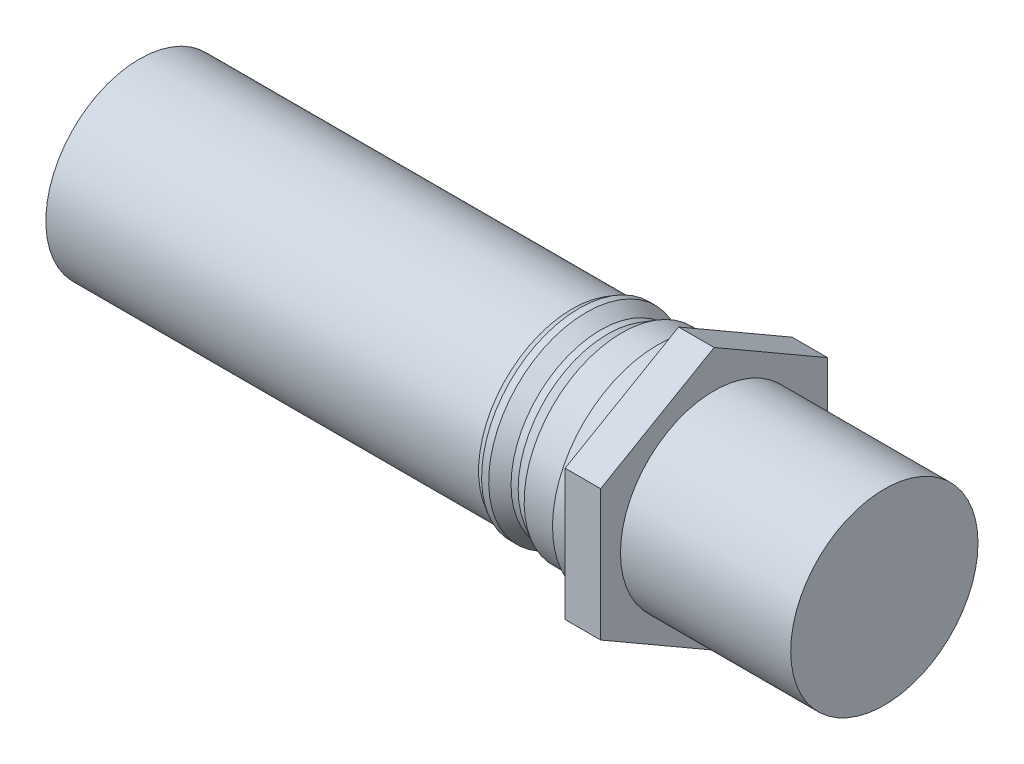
ISO-10303-21;
HEADER;
FILE_DESCRIPTION(('STEP AP214'),'2;1');
FILE_NAME('part.step','',(''),(''),'','','');
FILE_SCHEMA(('AUTOMOTIVE_DESIGN { 1 0 10303 214 1 1 1 1 }'));
ENDSEC;
DATA;
#1=APPLICATION_CONTEXT('core data for automotive mechanical design processes');
#2=APPLICATION_PROTOCOL_DEFINITION('international standard','automotive_design',2000,#1);
#3=PRODUCT_CONTEXT('',#1,'mechanical');
#4=PRODUCT('Part','Part','',(#3));
#5=PRODUCT_RELATED_PRODUCT_CATEGORY('part','',(#4));
#6=PRODUCT_DEFINITION_FORMATION('','',#4);
#7=PRODUCT_DEFINITION_CONTEXT('part definition',#1,'design');
#8=PRODUCT_DEFINITION('design','',#6,#7);
#9=PRODUCT_DEFINITION_SHAPE('','',#8);
#10=(LENGTH_UNIT() NAMED_UNIT(*) SI_UNIT(.MILLI.,.METRE.));
#11=(NAMED_UNIT(*) PLANE_ANGLE_UNIT() SI_UNIT($,.RADIAN.));
#12=(NAMED_UNIT(*) SI_UNIT($,.STERADIAN.) SOLID_ANGLE_UNIT());
#13=UNCERTAINTY_MEASURE_WITH_UNIT(LENGTH_MEASURE(1.E-05),#10,'distance_accuracy_value','');
#14=(GEOMETRIC_REPRESENTATION_CONTEXT(3) GLOBAL_UNCERTAINTY_ASSIGNED_CONTEXT((#13)) GLOBAL_UNIT_ASSIGNED_CONTEXT((#10,
#11,#12)) REPRESENTATION_CONTEXT('',''));
#15=CARTESIAN_POINT('',(0.,0.,0.));
#16=DIRECTION('',(0.,0.,1.));
#17=DIRECTION('',(1.,0.,0.));
#18=AXIS2_PLACEMENT_3D('',#15,#16,#17);
#19=CARTESIAN_POINT('',(0.,0.,0.));
#20=DIRECTION('',(-1.,0.,0.));
#21=DIRECTION('',(0.,-1.,0.));
#22=AXIS2_PLACEMENT_3D('',#19,#20,#21);
#23=PLANE('',#22);
#24=CARTESIAN_POINT('',(0.,0.,0.));
#25=DIRECTION('',(1.,0.,0.));
#26=DIRECTION('',(0.,1.,0.));
#27=AXIS2_PLACEMENT_3D('',#24,#25,#26);
#28=CIRCLE('',#27,13.2);
#29=CARTESIAN_POINT('',(0.,13.2,0.));
#30=VERTEX_POINT('',#29);
#31=EDGE_CURVE('E36',#30,#30,#28,.T.);
#32=ORIENTED_EDGE('',*,*,#31,.F.);
#33=EDGE_LOOP('',(#32));
#34=FACE_BOUND('',#33,.T.);
#35=ADVANCED_FACE('F33',(#34),#23,.T.);
#36=CARTESIAN_POINT('',(76.,0.,0.));
#37=DIRECTION('',(1.,0.,0.));
#38=DIRECTION('',(0.,1.,0.));
#39=AXIS2_PLACEMENT_3D('',#36,#37,#38);
#40=CYLINDRICAL_SURFACE('',#39,13.2);
#41=ORIENTED_EDGE('',*,*,#31,.T.);
#42=EDGE_LOOP('',(#41));
#43=FACE_BOUND('',#42,.T.);
#44=CARTESIAN_POINT('',(61.,0.,0.));
#45=DIRECTION('',(1.,0.,0.));
#46=DIRECTION('',(0.,1.,0.));
#47=AXIS2_PLACEMENT_3D('',#44,#45,#46);
#48=CIRCLE('',#47,13.2);
#49=CARTESIAN_POINT('',(61.,13.2,0.));
#50=VERTEX_POINT('',#49);
#51=EDGE_CURVE('E162',#50,#50,#48,.T.);
#52=ORIENTED_EDGE('',*,*,#51,.F.);
#53=EDGE_LOOP('',(#52));
#54=FACE_BOUND('',#53,.T.);
#55=ADVANCED_FACE('F169',(#43,#54),#40,.T.);
#56=CARTESIAN_POINT('',(62.,0.,0.));
#57=DIRECTION('',(1.,0.,0.));
#58=DIRECTION('',(0.,1.,0.));
#59=AXIS2_PLACEMENT_3D('',#56,#57,#58);
#60=CONICAL_SURFACE('',#59,13.7773502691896,0.5235987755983);
#61=ORIENTED_EDGE('',*,*,#51,.T.);
#62=EDGE_LOOP('',(#61));
#63=FACE_BOUND('',#62,.T.);
#64=CARTESIAN_POINT('',(62.,0.,0.));
#65=DIRECTION('',(1.,0.,0.));
#66=DIRECTION('',(0.,1.,0.));
#67=AXIS2_PLACEMENT_3D('',#64,#65,#66);
#68=CIRCLE('',#67,13.7773502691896);
#69=CARTESIAN_POINT('',(62.,13.7773502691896,0.));
#70=VERTEX_POINT('',#69);
#71=EDGE_CURVE('E160',#70,#70,#68,.T.);
#72=ORIENTED_EDGE('',*,*,#71,.F.);
#73=EDGE_LOOP('',(#72));
#74=FACE_BOUND('',#73,.T.);
#75=ADVANCED_FACE('F176',(#63,#74),#60,.T.);
#76=CARTESIAN_POINT('',(76.,0.,0.));
#77=DIRECTION('',(1.,0.,0.));
#78=DIRECTION('',(0.,1.,0.));
#79=AXIS2_PLACEMENT_3D('',#76,#77,#78);
#80=CYLINDRICAL_SURFACE('',#79,13.7773502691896);
#81=ORIENTED_EDGE('',*,*,#71,.T.);
#82=EDGE_LOOP('',(#81));
#83=FACE_BOUND('',#82,.T.);
#84=CARTESIAN_POINT('',(63.,0.,0.));
#85=DIRECTION('',(1.,0.,0.));
#86=DIRECTION('',(0.,1.,0.));
#87=AXIS2_PLACEMENT_3D('',#84,#85,#86);
#88=CIRCLE('',#87,13.7773502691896);
#89=CARTESIAN_POINT('',(63.,13.7773502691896,0.));
#90=VERTEX_POINT('',#89);
#91=EDGE_CURVE('E157',#90,#90,#88,.T.);
#92=ORIENTED_EDGE('',*,*,#91,.F.);
#93=EDGE_LOOP('',(#92));
#94=FACE_BOUND('',#93,.T.);
#95=ADVANCED_FACE('F180',(#83,#94),#80,.T.);
#96=CARTESIAN_POINT('',(65.,0.,0.));
#97=DIRECTION('',(-1.,0.,0.));
#98=DIRECTION('',(0.,-1.,0.));
#99=AXIS2_PLACEMENT_3D('',#96,#97,#98);
#100=CONICAL_SURFACE('',#99,12.6226497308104,0.523598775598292);
#101=ORIENTED_EDGE('',*,*,#91,.T.);
#102=EDGE_LOOP('',(#101));
#103=FACE_BOUND('',#102,.T.);
#104=CARTESIAN_POINT('',(65.,0.,0.));
#105=DIRECTION('',(1.,0.,0.));
#106=DIRECTION('',(0.,1.,0.));
#107=AXIS2_PLACEMENT_3D('',#104,#105,#106);
#108=CIRCLE('',#107,12.6226497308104);
#109=CARTESIAN_POINT('',(65.,12.6226497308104,0.));
#110=VERTEX_POINT('',#109);
#111=EDGE_CURVE('E154',#110,#110,#108,.T.);
#112=ORIENTED_EDGE('',*,*,#111,.F.);
#113=EDGE_LOOP('',(#112));
#114=FACE_BOUND('',#113,.T.);
#115=ADVANCED_FACE('F185',(#103,#114),#100,.T.);
#116=CARTESIAN_POINT('',(76.,0.,0.));
#117=DIRECTION('',(1.,0.,0.));
#118=DIRECTION('',(0.,1.,0.));
#119=AXIS2_PLACEMENT_3D('',#116,#117,#118);
#120=CYLINDRICAL_SURFACE('',#119,12.6226497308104);
#121=ORIENTED_EDGE('',*,*,#111,.T.);
#122=EDGE_LOOP('',(#121));
#123=FACE_BOUND('',#122,.T.);
#124=CARTESIAN_POINT('',(66.,0.,0.));
#125=DIRECTION('',(1.,0.,0.));
#126=DIRECTION('',(0.,1.,0.));
#127=AXIS2_PLACEMENT_3D('',#124,#125,#126);
#128=CIRCLE('',#127,12.6226497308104);
#129=CARTESIAN_POINT('',(66.,12.6226497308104,0.));
#130=VERTEX_POINT('',#129);
#131=EDGE_CURVE('E151',#130,#130,#128,.T.);
#132=ORIENTED_EDGE('',*,*,#131,.F.);
#133=EDGE_LOOP('',(#132));
#134=FACE_BOUND('',#133,.T.);
#135=ADVANCED_FACE('F189',(#123,#134),#120,.T.);
#136=CARTESIAN_POINT('',(68.,0.,0.));
#137=DIRECTION('',(1.,0.,0.));
#138=DIRECTION('',(0.,1.,0.));
#139=AXIS2_PLACEMENT_3D('',#136,#137,#138);
#140=CONICAL_SURFACE('',#139,13.7773502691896,0.523598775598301);
#141=ORIENTED_EDGE('',*,*,#131,.T.);
#142=EDGE_LOOP('',(#141));
#143=FACE_BOUND('',#142,.T.);
#144=CARTESIAN_POINT('',(68.,0.,0.));
#145=DIRECTION('',(1.,0.,0.));
#146=DIRECTION('',(0.,1.,0.));
#147=AXIS2_PLACEMENT_3D('',#144,#145,#146);
#148=CIRCLE('',#147,13.7773502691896);
#149=CARTESIAN_POINT('',(68.,13.7773502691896,0.));
#150=VERTEX_POINT('',#149);
#151=EDGE_CURVE('E148',#150,#150,#148,.T.);
#152=ORIENTED_EDGE('',*,*,#151,.F.);
#153=EDGE_LOOP('',(#152));
#154=FACE_BOUND('',#153,.T.);
#155=ADVANCED_FACE('F193',(#143,#154),#140,.T.);
#156=CARTESIAN_POINT('',(76.,0.,0.));
#157=DIRECTION('',(1.,0.,0.));
#158=DIRECTION('',(0.,1.,0.));
#159=AXIS2_PLACEMENT_3D('',#156,#157,#158);
#160=CYLINDRICAL_SURFACE('',#159,13.7773502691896);
#161=ORIENTED_EDGE('',*,*,#151,.T.);
#162=EDGE_LOOP('',(#161));
#163=FACE_BOUND('',#162,.T.);
#164=CARTESIAN_POINT('',(73.,0.,0.));
#165=DIRECTION('',(1.,0.,0.));
#166=DIRECTION('',(0.,1.,0.));
#167=AXIS2_PLACEMENT_3D('',#164,#165,#166);
#168=CIRCLE('',#167,13.7773502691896);
#169=CARTESIAN_POINT('',(73.,13.7773502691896,0.));
#170=VERTEX_POINT('',#169);
#171=EDGE_CURVE('E145',#170,#170,#168,.T.);
#172=ORIENTED_EDGE('',*,*,#171,.F.);
#173=EDGE_LOOP('',(#172));
#174=FACE_BOUND('',#173,.T.);
#175=ADVANCED_FACE('F197',(#163,#174),#160,.T.);
#176=CARTESIAN_POINT('',(73.,13.7773502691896,0.));
#177=DIRECTION('',(-1.,0.,0.));
#178=DIRECTION('',(0.,-1.,0.));
#179=AXIS2_PLACEMENT_3D('',#176,#177,#178);
#180=PLANE('',#179);
#181=ORIENTED_EDGE('',*,*,#171,.T.);
#182=EDGE_LOOP('',(#181));
#183=FACE_BOUND('',#182,.T.);
#184=CARTESIAN_POINT('',(73.,0.,0.));
#185=DIRECTION('',(1.,0.,0.));
#186=DIRECTION('',(0.,1.,0.));
#187=AXIS2_PLACEMENT_3D('',#184,#185,#186);
#188=CIRCLE('',#187,14.7773502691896);
#189=CARTESIAN_POINT('',(73.,14.7773502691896,0.));
#190=VERTEX_POINT('',#189);
#191=EDGE_CURVE('E142',#190,#190,#188,.T.);
#192=ORIENTED_EDGE('',*,*,#191,.F.);
#193=EDGE_LOOP('',(#192));
#194=FACE_BOUND('',#193,.T.);
#195=ADVANCED_FACE('F201',(#183,#194),#180,.T.);
#196=CARTESIAN_POINT('',(76.,0.,0.));
#197=DIRECTION('',(1.,0.,0.));
#198=DIRECTION('',(0.,1.,0.));
#199=AXIS2_PLACEMENT_3D('',#196,#197,#198);
#200=CYLINDRICAL_SURFACE('',#199,14.7773502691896);
#201=ORIENTED_EDGE('',*,*,#191,.T.);
#202=EDGE_LOOP('',(#201));
#203=FACE_BOUND('',#202,.T.);
#204=CARTESIAN_POINT('',(76.,0.,0.));
#205=DIRECTION('',(1.,0.,0.));
#206=DIRECTION('',(0.,1.,0.));
#207=AXIS2_PLACEMENT_3D('',#204,#205,#206);
#208=CIRCLE('',#207,14.7773502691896);
#209=CARTESIAN_POINT('',(76.,14.7773502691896,0.));
#210=VERTEX_POINT('',#209);
#211=EDGE_CURVE('E139',#210,#210,#208,.T.);
#212=ORIENTED_EDGE('',*,*,#211,.F.);
#213=EDGE_LOOP('',(#212));
#214=FACE_BOUND('',#213,.T.);
#215=ADVANCED_FACE('F205',(#203,#214),#200,.T.);
#216=CARTESIAN_POINT('',(81.,9.23760430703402,-16.));
#217=DIRECTION('',(0.,-0.866025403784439,0.5));
#218=DIRECTION('',(0.,-0.5,-0.866025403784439));
#219=AXIS2_PLACEMENT_3D('',#216,#217,#218);
#220=PLANE('',#219);
#221=DIRECTION('',(0.,0.5,0.866025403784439));
#222=VECTOR('',#221,1.);
#223=CARTESIAN_POINT('',(76.,9.23760430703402,-16.));
#224=LINE('',#223,#222);
#225=CARTESIAN_POINT('',(76.,9.23760430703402,-16.));
#226=VERTEX_POINT('',#225);
#227=CARTESIAN_POINT('',(76.,18.475208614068,0.));
#228=VERTEX_POINT('',#227);
#229=EDGE_CURVE('E119',#226,#228,#224,.T.);
#230=ORIENTED_EDGE('',*,*,#229,.T.);
#231=DIRECTION('',(-1.,0.,0.));
#232=VECTOR('',#231,1.);
#233=CARTESIAN_POINT('',(81.,18.475208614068,0.));
#234=LINE('',#233,#232);
#235=CARTESIAN_POINT('',(81.,18.475208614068,0.));
#236=VERTEX_POINT('',#235);
#237=EDGE_CURVE('E137',#236,#228,#234,.T.);
#238=ORIENTED_EDGE('',*,*,#237,.F.);
#239=DIRECTION('',(0.,0.5,0.866025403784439));
#240=VECTOR('',#239,1.);
#241=CARTESIAN_POINT('',(81.,9.23760430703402,-16.));
#242=LINE('',#241,#240);
#243=CARTESIAN_POINT('',(81.,9.23760430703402,-16.));
#244=VERTEX_POINT('',#243);
#245=EDGE_CURVE('E130',#244,#236,#242,.T.);
#246=ORIENTED_EDGE('',*,*,#245,.F.);
#247=DIRECTION('',(-1.,0.,0.));
#248=VECTOR('',#247,1.);
#249=CARTESIAN_POINT('',(81.,9.23760430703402,-16.));
#250=LINE('',#249,#248);
#251=EDGE_CURVE('E115',#244,#226,#250,.T.);
#252=ORIENTED_EDGE('',*,*,#251,.T.);
#253=EDGE_LOOP('',(#230,#238,#246,#252));
#254=FACE_BOUND('',#253,.T.);
#255=ADVANCED_FACE('F209',(#254),#220,.F.);
#256=CARTESIAN_POINT('',(81.,18.475208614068,0.));
#257=DIRECTION('',(0.,-0.866025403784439,-0.5));
#258=DIRECTION('',(0.,0.5,-0.866025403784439));
#259=AXIS2_PLACEMENT_3D('',#256,#257,#258);
#260=PLANE('',#259);
#261=DIRECTION('',(0.,-0.5,0.866025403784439));
#262=VECTOR('',#261,1.);
#263=CARTESIAN_POINT('',(76.,18.475208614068,0.));
#264=LINE('',#263,#262);
#265=CARTESIAN_POINT('',(76.,9.23760430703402,16.));
#266=VERTEX_POINT('',#265);
#267=EDGE_CURVE('E122',#228,#266,#264,.T.);
#268=ORIENTED_EDGE('',*,*,#267,.T.);
#269=DIRECTION('',(-1.,0.,0.));
#270=VECTOR('',#269,1.);
#271=CARTESIAN_POINT('',(81.,9.23760430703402,16.));
#272=LINE('',#271,#270);
#273=CARTESIAN_POINT('',(81.,9.23760430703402,16.));
#274=VERTEX_POINT('',#273);
#275=EDGE_CURVE('E134',#274,#266,#272,.T.);
#276=ORIENTED_EDGE('',*,*,#275,.F.);
#277=DIRECTION('',(0.,-0.5,0.866025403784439));
#278=VECTOR('',#277,1.);
#279=CARTESIAN_POINT('',(81.,18.475208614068,0.));
#280=LINE('',#279,#278);
#281=EDGE_CURVE('E88',#236,#274,#280,.T.);
#282=ORIENTED_EDGE('',*,*,#281,.F.);
#283=ORIENTED_EDGE('',*,*,#237,.T.);
#284=EDGE_LOOP('',(#268,#276,#282,#283));
#285=FACE_BOUND('',#284,.T.);
#286=ADVANCED_FACE('F213',(#285),#260,.F.);
#287=CARTESIAN_POINT('',(81.,9.23760430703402,16.));
#288=DIRECTION('',(0.,0.,-1.));
#289=DIRECTION('',(-1.,0.,0.));
#290=AXIS2_PLACEMENT_3D('',#287,#288,#289);
#291=PLANE('',#290);
#292=DIRECTION('',(0.,-1.,0.));
#293=VECTOR('',#292,1.);
#294=CARTESIAN_POINT('',(76.,9.23760430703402,16.));
#295=LINE('',#294,#293);
#296=CARTESIAN_POINT('',(76.,-9.23760430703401,16.));
#297=VERTEX_POINT('',#296);
#298=EDGE_CURVE('E125',#266,#297,#295,.T.);
#299=ORIENTED_EDGE('',*,*,#298,.T.);
#300=DIRECTION('',(-1.,0.,0.));
#301=VECTOR('',#300,1.);
#302=CARTESIAN_POINT('',(81.,-9.23760430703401,16.));
#303=LINE('',#302,#301);
#304=CARTESIAN_POINT('',(81.,-9.23760430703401,16.));
#305=VERTEX_POINT('',#304);
#306=EDGE_CURVE('E110',#305,#297,#303,.T.);
#307=ORIENTED_EDGE('',*,*,#306,.F.);
#308=DIRECTION('',(0.,-1.,0.));
#309=VECTOR('',#308,1.);
#310=CARTESIAN_POINT('',(81.,9.23760430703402,16.));
#311=LINE('',#310,#309);
#312=EDGE_CURVE('E101',#274,#305,#311,.T.);
#313=ORIENTED_EDGE('',*,*,#312,.F.);
#314=ORIENTED_EDGE('',*,*,#275,.T.);
#315=EDGE_LOOP('',(#299,#307,#313,#314));
#316=FACE_BOUND('',#315,.T.);
#317=ADVANCED_FACE('F217',(#316),#291,.F.);
#318=CARTESIAN_POINT('',(81.,-9.23760430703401,16.));
#319=DIRECTION('',(0.,0.866025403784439,-0.5));
#320=DIRECTION('',(0.,0.5,0.866025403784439));
#321=AXIS2_PLACEMENT_3D('',#318,#319,#320);
#322=PLANE('',#321);
#323=DIRECTION('',(0.,-0.5,-0.866025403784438));
#324=VECTOR('',#323,1.);
#325=CARTESIAN_POINT('',(76.,-9.23760430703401,16.));
#326=LINE('',#325,#324);
#327=CARTESIAN_POINT('',(76.,-18.475208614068,0.));
#328=VERTEX_POINT('',#327);
#329=EDGE_CURVE('E109',#297,#328,#326,.T.);
#330=ORIENTED_EDGE('',*,*,#329,.T.);
#331=DIRECTION('',(-1.,0.,0.));
#332=VECTOR('',#331,1.);
#333=CARTESIAN_POINT('',(81.,-18.475208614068,0.));
#334=LINE('',#333,#332);
#335=CARTESIAN_POINT('',(81.,-18.475208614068,0.));
#336=VERTEX_POINT('',#335);
#337=EDGE_CURVE('E106',#336,#328,#334,.T.);
#338=ORIENTED_EDGE('',*,*,#337,.F.);
#339=DIRECTION('',(0.,-0.5,-0.866025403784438));
#340=VECTOR('',#339,1.);
#341=CARTESIAN_POINT('',(81.,-9.23760430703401,16.));
#342=LINE('',#341,#340);
#343=EDGE_CURVE('E95',#305,#336,#342,.T.);
#344=ORIENTED_EDGE('',*,*,#343,.F.);
#345=ORIENTED_EDGE('',*,*,#306,.T.);
#346=EDGE_LOOP('',(#330,#338,#344,#345));
#347=FACE_BOUND('',#346,.T.);
#348=ADVANCED_FACE('F107',(#347),#322,.F.);
#349=CARTESIAN_POINT('',(81.,-18.475208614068,0.));
#350=DIRECTION('',(0.,0.866025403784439,0.5));
#351=DIRECTION('',(0.,-0.5,0.866025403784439));
#352=AXIS2_PLACEMENT_3D('',#349,#350,#351);
#353=PLANE('',#352);
#354=DIRECTION('',(0.,0.5,-0.866025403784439));
#355=VECTOR('',#354,1.);
#356=CARTESIAN_POINT('',(76.,-18.475208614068,0.));
#357=LINE('',#356,#355);
#358=CARTESIAN_POINT('',(76.,-9.23760430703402,-16.));
#359=VERTEX_POINT('',#358);
#360=EDGE_CURVE('E73',#328,#359,#357,.T.);
#361=ORIENTED_EDGE('',*,*,#360,.T.);
#362=DIRECTION('',(-1.,0.,0.));
#363=VECTOR('',#362,1.);
#364=CARTESIAN_POINT('',(81.,-9.23760430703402,-16.));
#365=LINE('',#364,#363);
#366=CARTESIAN_POINT('',(81.,-9.23760430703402,-16.));
#367=VERTEX_POINT('',#366);
#368=EDGE_CURVE('E111',#367,#359,#365,.T.);
#369=ORIENTED_EDGE('',*,*,#368,.F.);
#370=DIRECTION('',(0.,0.5,-0.866025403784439));
#371=VECTOR('',#370,1.);
#372=CARTESIAN_POINT('',(81.,-18.475208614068,0.));
#373=LINE('',#372,#371);
#374=EDGE_CURVE('E99',#336,#367,#373,.T.);
#375=ORIENTED_EDGE('',*,*,#374,.F.);
#376=ORIENTED_EDGE('',*,*,#337,.T.);
#377=EDGE_LOOP('',(#361,#369,#375,#376));
#378=FACE_BOUND('',#377,.T.);
#379=ADVANCED_FACE('F113',(#378),#353,.F.);
#380=CARTESIAN_POINT('',(81.,-9.23760430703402,-16.));
#381=DIRECTION('',(0.,0.,1.));
#382=DIRECTION('',(1.,0.,0.));
#383=AXIS2_PLACEMENT_3D('',#380,#381,#382);
#384=PLANE('',#383);
#385=DIRECTION('',(0.,1.,0.));
#386=VECTOR('',#385,1.);
#387=CARTESIAN_POINT('',(76.,-9.23760430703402,-16.));
#388=LINE('',#387,#386);
#389=EDGE_CURVE('E79',#359,#226,#388,.T.);
#390=ORIENTED_EDGE('',*,*,#389,.T.);
#391=ORIENTED_EDGE('',*,*,#251,.F.);
#392=DIRECTION('',(0.,1.,0.));
#393=VECTOR('',#392,1.);
#394=CARTESIAN_POINT('',(81.,-9.23760430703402,-16.));
#395=LINE('',#394,#393);
#396=EDGE_CURVE('E50',#367,#244,#395,.T.);
#397=ORIENTED_EDGE('',*,*,#396,.F.);
#398=ORIENTED_EDGE('',*,*,#368,.T.);
#399=EDGE_LOOP('',(#390,#391,#397,#398));
#400=FACE_BOUND('',#399,.T.);
#401=ADVANCED_FACE('F225',(#400),#384,.F.);
#402=CARTESIAN_POINT('',(81.,0.,0.));
#403=DIRECTION('',(1.,0.,0.));
#404=DIRECTION('',(0.,0.,-1.));
#405=AXIS2_PLACEMENT_3D('',#402,#403,#404);
#406=PLANE('',#405);
#407=CARTESIAN_POINT('',(81.,0.,0.));
#408=DIRECTION('',(1.,0.,0.));
#409=DIRECTION('',(0.,0.,-1.));
#410=AXIS2_PLACEMENT_3D('',#407,#408,#409);
#411=CIRCLE('',#410,13.2);
#412=CARTESIAN_POINT('',(81.,0.,-13.2));
#413=VERTEX_POINT('',#412);
#414=EDGE_CURVE('E11',#413,#413,#411,.T.);
#415=ORIENTED_EDGE('',*,*,#414,.F.);
#416=EDGE_LOOP('',(#415));
#417=FACE_BOUND('',#416,.T.);
#418=ORIENTED_EDGE('',*,*,#245,.T.);
#419=ORIENTED_EDGE('',*,*,#281,.T.);
#420=ORIENTED_EDGE('',*,*,#312,.T.);
#421=ORIENTED_EDGE('',*,*,#343,.T.);
#422=ORIENTED_EDGE('',*,*,#374,.T.);
#423=ORIENTED_EDGE('',*,*,#396,.T.);
#424=EDGE_LOOP('',(#418,#419,#420,#421,#422,#423));
#425=FACE_BOUND('',#424,.T.);
#426=ADVANCED_FACE('F97',(#417,#425),#406,.T.);
#427=CARTESIAN_POINT('',(76.,0.,0.));
#428=DIRECTION('',(1.,0.,0.));
#429=DIRECTION('',(0.,0.,-1.));
#430=AXIS2_PLACEMENT_3D('',#427,#428,#429);
#431=PLANE('',#430);
#432=ORIENTED_EDGE('',*,*,#211,.T.);
#433=EDGE_LOOP('',(#432));
#434=FACE_BOUND('',#433,.T.);
#435=ORIENTED_EDGE('',*,*,#229,.F.);
#436=ORIENTED_EDGE('',*,*,#389,.F.);
#437=ORIENTED_EDGE('',*,*,#360,.F.);
#438=ORIENTED_EDGE('',*,*,#329,.F.);
#439=ORIENTED_EDGE('',*,*,#298,.F.);
#440=ORIENTED_EDGE('',*,*,#267,.F.);
#441=EDGE_LOOP('',(#435,#436,#437,#438,#439,#440));
#442=FACE_BOUND('',#441,.T.);
#443=ADVANCED_FACE('F228',(#434,#442),#431,.F.);
#444=CARTESIAN_POINT('',(81.,0.,0.));
#445=DIRECTION('',(1.,0.,0.));
#446=DIRECTION('',(0.,0.,-1.));
#447=AXIS2_PLACEMENT_3D('',#444,#445,#446);
#448=CYLINDRICAL_SURFACE('',#447,13.2);
#449=ORIENTED_EDGE('',*,*,#414,.T.);
#450=EDGE_LOOP('',(#449));
#451=FACE_BOUND('',#450,.T.);
#452=CARTESIAN_POINT('',(105.,0.,0.));
#453=DIRECTION('',(1.,0.,0.));
#454=DIRECTION('',(0.,0.,-1.));
#455=AXIS2_PLACEMENT_3D('',#452,#453,#454);
#456=CIRCLE('',#455,13.2);
#457=CARTESIAN_POINT('',(105.,0.,-13.2));
#458=VERTEX_POINT('',#457);
#459=EDGE_CURVE('E123',#458,#458,#456,.T.);
#460=ORIENTED_EDGE('',*,*,#459,.F.);
#461=EDGE_LOOP('',(#460));
#462=FACE_BOUND('',#461,.T.);
#463=ADVANCED_FACE('F231',(#451,#462),#448,.T.);
#464=CARTESIAN_POINT('',(105.,13.2,0.));
#465=DIRECTION('',(1.,0.,0.));
#466=DIRECTION('',(0.,0.,-1.));
#467=AXIS2_PLACEMENT_3D('',#464,#465,#466);
#468=PLANE('',#467);
#469=ORIENTED_EDGE('',*,*,#459,.T.);
#470=EDGE_LOOP('',(#469));
#471=FACE_BOUND('',#470,.T.);
#472=ADVANCED_FACE('F238',(#471),#468,.T.);
#473=CLOSED_SHELL('',(#35,#55,#75,#95,#115,#135,#155,#175,#195,#215,#255,#286,#317,#348,#379,
#401,#426,#443,#463,#472));
#474=MANIFOLD_SOLID_BREP('B2',#473);
#475=ADVANCED_BREP_SHAPE_REPRESENTATION('',(#18,#474),#14);
#476=SHAPE_DEFINITION_REPRESENTATION(#9,#475);
ENDSEC;
END-ISO-10303-21;
